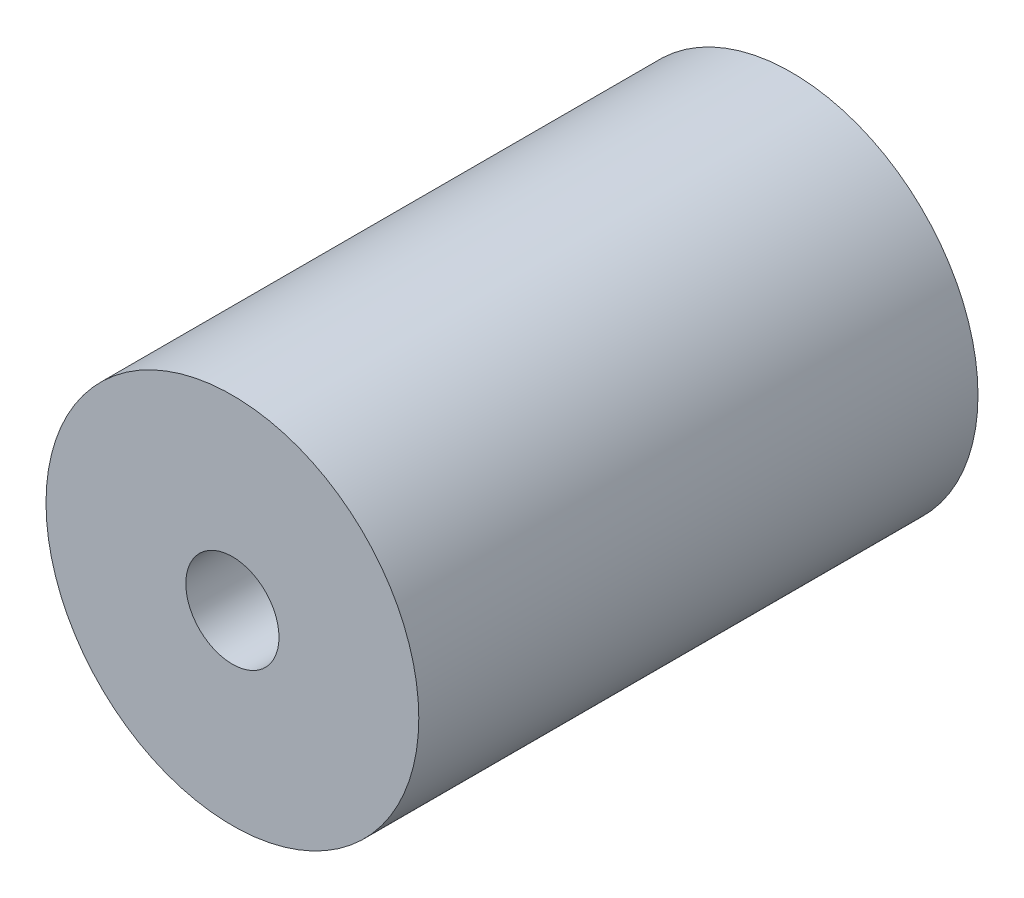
ISO-10303-21;
HEADER;
FILE_DESCRIPTION(('STEP AP214'),'2;1');
FILE_NAME('part.step','',(''),(''),'','','');
FILE_SCHEMA(('AUTOMOTIVE_DESIGN { 1 0 10303 214 1 1 1 1 }'));
ENDSEC;
DATA;
#1=APPLICATION_CONTEXT('core data for automotive mechanical design processes');
#2=APPLICATION_PROTOCOL_DEFINITION('international standard','automotive_design',2000,#1);
#3=PRODUCT_CONTEXT('',#1,'mechanical');
#4=PRODUCT('Part','Part','',(#3));
#5=PRODUCT_RELATED_PRODUCT_CATEGORY('part','',(#4));
#6=PRODUCT_DEFINITION_FORMATION('','',#4);
#7=PRODUCT_DEFINITION_CONTEXT('part definition',#1,'design');
#8=PRODUCT_DEFINITION('design','',#6,#7);
#9=PRODUCT_DEFINITION_SHAPE('','',#8);
#10=(LENGTH_UNIT() NAMED_UNIT(*) SI_UNIT(.MILLI.,.METRE.));
#11=(NAMED_UNIT(*) PLANE_ANGLE_UNIT() SI_UNIT($,.RADIAN.));
#12=(NAMED_UNIT(*) SI_UNIT($,.STERADIAN.) SOLID_ANGLE_UNIT());
#13=UNCERTAINTY_MEASURE_WITH_UNIT(LENGTH_MEASURE(1.E-05),#10,'distance_accuracy_value','');
#14=(GEOMETRIC_REPRESENTATION_CONTEXT(3) GLOBAL_UNCERTAINTY_ASSIGNED_CONTEXT((#13)) GLOBAL_UNIT_ASSIGNED_CONTEXT((#10,
#11,#12)) REPRESENTATION_CONTEXT('',''));
#15=CARTESIAN_POINT('',(0.,0.,0.));
#16=DIRECTION('',(0.,0.,1.));
#17=DIRECTION('',(1.,0.,0.));
#18=AXIS2_PLACEMENT_3D('',#15,#16,#17);
#19=CARTESIAN_POINT('',(0.,4.44089209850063E-13,300.));
#20=DIRECTION('',(0.,0.,1.));
#21=DIRECTION('',(1.00000000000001,0.,0.));
#22=AXIS2_PLACEMENT_3D('',#19,#20,#21);
#23=PLANE('',#22);
#24=CARTESIAN_POINT('',(0.,4.44089209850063E-13,300.));
#25=DIRECTION('',(0.,0.,1.));
#26=DIRECTION('',(1.00000000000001,0.,0.));
#27=AXIS2_PLACEMENT_3D('',#24,#25,#26);
#28=CIRCLE('',#27,200.);
#29=CARTESIAN_POINT('',(200.000000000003,4.44089209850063E-13,300.));
#30=VERTEX_POINT('',#29);
#31=EDGE_CURVE('E10',#30,#30,#28,.T.);
#32=ORIENTED_EDGE('',*,*,#31,.T.);
#33=EDGE_LOOP('',(#32));
#34=FACE_BOUND('',#33,.T.);
#35=CARTESIAN_POINT('',(0.,4.44089209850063E-13,300.));
#36=DIRECTION('',(0.,0.,1.));
#37=DIRECTION('',(1.00000000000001,0.,0.));
#38=AXIS2_PLACEMENT_3D('',#35,#36,#37);
#39=CIRCLE('',#38,50.);
#40=CARTESIAN_POINT('',(50.0000000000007,4.44089209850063E-13,300.));
#41=VERTEX_POINT('',#40);
#42=EDGE_CURVE('E48',#41,#41,#39,.T.);
#43=ORIENTED_EDGE('',*,*,#42,.F.);
#44=EDGE_LOOP('',(#43));
#45=FACE_BOUND('',#44,.T.);
#46=ADVANCED_FACE('F34',(#34,#45),#23,.T.);
#47=CARTESIAN_POINT('',(0.,6.66133814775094E-13,-300.));
#48=DIRECTION('',(0.,0.,1.));
#49=DIRECTION('',(1.00000000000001,0.,0.));
#50=AXIS2_PLACEMENT_3D('',#47,#48,#49);
#51=PLANE('',#50);
#52=CARTESIAN_POINT('',(0.,6.66133814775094E-13,-300.));
#53=DIRECTION('',(0.,0.,1.));
#54=DIRECTION('',(1.00000000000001,0.,0.));
#55=AXIS2_PLACEMENT_3D('',#52,#53,#54);
#56=CIRCLE('',#55,200.);
#57=CARTESIAN_POINT('',(200.000000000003,6.66133814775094E-13,-300.));
#58=VERTEX_POINT('',#57);
#59=EDGE_CURVE('E42',#58,#58,#56,.T.);
#60=ORIENTED_EDGE('',*,*,#59,.F.);
#61=EDGE_LOOP('',(#60));
#62=FACE_BOUND('',#61,.T.);
#63=CARTESIAN_POINT('',(0.,6.66133814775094E-13,-300.));
#64=DIRECTION('',(0.,0.,1.));
#65=DIRECTION('',(1.00000000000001,0.,0.));
#66=AXIS2_PLACEMENT_3D('',#63,#64,#65);
#67=CIRCLE('',#66,50.);
#68=CARTESIAN_POINT('',(50.0000000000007,6.66133814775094E-13,-300.));
#69=VERTEX_POINT('',#68);
#70=EDGE_CURVE('E53',#69,#69,#67,.T.);
#71=ORIENTED_EDGE('',*,*,#70,.T.);
#72=EDGE_LOOP('',(#71));
#73=FACE_BOUND('',#72,.T.);
#74=ADVANCED_FACE('F59',(#62,#73),#51,.F.);
#75=CARTESIAN_POINT('',(0.,4.44089209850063E-13,300.));
#76=DIRECTION('',(0.,0.,-1.));
#77=DIRECTION('',(-1.00000000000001,0.,0.));
#78=AXIS2_PLACEMENT_3D('',#75,#76,#77);
#79=CYLINDRICAL_SURFACE('',#78,200.);
#80=ORIENTED_EDGE('',*,*,#31,.F.);
#81=EDGE_LOOP('',(#80));
#82=FACE_BOUND('',#81,.T.);
#83=ORIENTED_EDGE('',*,*,#59,.T.);
#84=EDGE_LOOP('',(#83));
#85=FACE_BOUND('',#84,.T.);
#86=ADVANCED_FACE('F36',(#82,#85),#79,.T.);
#87=CARTESIAN_POINT('',(0.,4.44089209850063E-13,300.));
#88=DIRECTION('',(0.,0.,-1.));
#89=DIRECTION('',(-1.00000000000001,0.,0.));
#90=AXIS2_PLACEMENT_3D('',#87,#88,#89);
#91=CYLINDRICAL_SURFACE('',#90,50.);
#92=ORIENTED_EDGE('',*,*,#42,.T.);
#93=EDGE_LOOP('',(#92));
#94=FACE_BOUND('',#93,.T.);
#95=ORIENTED_EDGE('',*,*,#70,.F.);
#96=EDGE_LOOP('',(#95));
#97=FACE_BOUND('',#96,.T.);
#98=ADVANCED_FACE('F61',(#94,#97),#91,.F.);
#99=CLOSED_SHELL('',(#46,#74,#86,#98));
#100=MANIFOLD_SOLID_BREP('B2',#99);
#101=ADVANCED_BREP_SHAPE_REPRESENTATION('',(#18,#100),#14);
#102=SHAPE_DEFINITION_REPRESENTATION(#9,#101);
ENDSEC;
END-ISO-10303-21;
